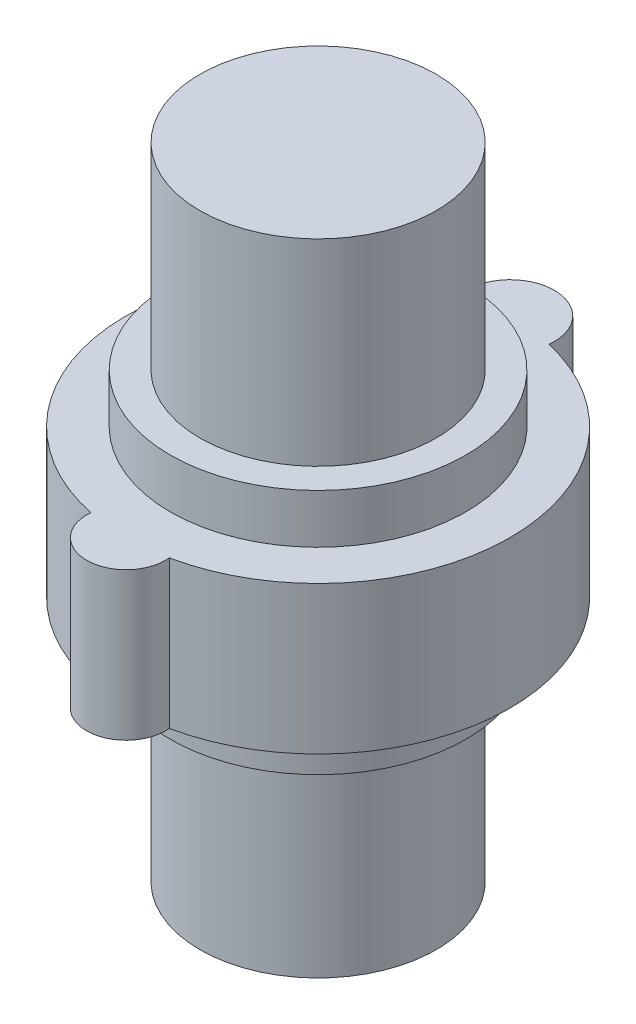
ISO-10303-21;
HEADER;
FILE_DESCRIPTION(('STEP AP214'),'2;1');
FILE_NAME('part.step','',(''),(''),'','','');
FILE_SCHEMA(('AUTOMOTIVE_DESIGN { 1 0 10303 214 1 1 1 1 }'));
ENDSEC;
DATA;
#1=APPLICATION_CONTEXT('core data for automotive mechanical design processes');
#2=APPLICATION_PROTOCOL_DEFINITION('international standard','automotive_design',2000,#1);
#3=PRODUCT_CONTEXT('',#1,'mechanical');
#4=PRODUCT('Part','Part','',(#3));
#5=PRODUCT_RELATED_PRODUCT_CATEGORY('part','',(#4));
#6=PRODUCT_DEFINITION_FORMATION('','',#4);
#7=PRODUCT_DEFINITION_CONTEXT('part definition',#1,'design');
#8=PRODUCT_DEFINITION('design','',#6,#7);
#9=PRODUCT_DEFINITION_SHAPE('','',#8);
#10=(LENGTH_UNIT() NAMED_UNIT(*) SI_UNIT(.MILLI.,.METRE.));
#11=(NAMED_UNIT(*) PLANE_ANGLE_UNIT() SI_UNIT($,.RADIAN.));
#12=(NAMED_UNIT(*) SI_UNIT($,.STERADIAN.) SOLID_ANGLE_UNIT());
#13=UNCERTAINTY_MEASURE_WITH_UNIT(LENGTH_MEASURE(1.E-05),#10,'distance_accuracy_value','');
#14=(GEOMETRIC_REPRESENTATION_CONTEXT(3) GLOBAL_UNCERTAINTY_ASSIGNED_CONTEXT((#13)) GLOBAL_UNIT_ASSIGNED_CONTEXT((#10,
#11,#12)) REPRESENTATION_CONTEXT('',''));
#15=CARTESIAN_POINT('',(0.,0.,0.));
#16=DIRECTION('',(0.,0.,1.));
#17=DIRECTION('',(1.,0.,0.));
#18=AXIS2_PLACEMENT_3D('',#15,#16,#17);
#19=CARTESIAN_POINT('',(0.,3.,-3.9));
#20=DIRECTION('',(0.,-1.,0.));
#21=DIRECTION('',(0.,0.,-1.));
#22=AXIS2_PLACEMENT_3D('',#19,#20,#21);
#23=CYLINDRICAL_SURFACE('',#22,0.9);
#24=CARTESIAN_POINT('',(0.,0.,-3.9));
#25=DIRECTION('',(0.,1.,0.));
#26=DIRECTION('',(0.,0.,-1.));
#27=AXIS2_PLACEMENT_3D('',#24,#25,#26);
#28=CIRCLE('',#27,0.9);
#29=CARTESIAN_POINT('',(0.893988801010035,0.,-3.79615384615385));
#30=VERTEX_POINT('',#29);
#31=CARTESIAN_POINT('',(-0.893988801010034,0.,-3.79615384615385));
#32=VERTEX_POINT('',#31);
#33=EDGE_CURVE('E103',#30,#32,#28,.T.);
#34=ORIENTED_EDGE('',*,*,#33,.T.);
#35=DIRECTION('',(0.,-1.,0.));
#36=VECTOR('',#35,1.);
#37=CARTESIAN_POINT('',(-0.893988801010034,3.,-3.79615384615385));
#38=LINE('',#37,#36);
#39=CARTESIAN_POINT('',(-0.893988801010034,3.,-3.79615384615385));
#40=VERTEX_POINT('',#39);
#41=EDGE_CURVE('E39',#40,#32,#38,.T.);
#42=ORIENTED_EDGE('',*,*,#41,.F.);
#43=CARTESIAN_POINT('',(0.,3.,-3.9));
#44=DIRECTION('',(0.,1.,0.));
#45=DIRECTION('',(0.,0.,-1.));
#46=AXIS2_PLACEMENT_3D('',#43,#44,#45);
#47=CIRCLE('',#46,0.9);
#48=CARTESIAN_POINT('',(0.893988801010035,3.,-3.79615384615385));
#49=VERTEX_POINT('',#48);
#50=EDGE_CURVE('E90',#49,#40,#47,.T.);
#51=ORIENTED_EDGE('',*,*,#50,.F.);
#52=DIRECTION('',(0.,-1.,0.));
#53=VECTOR('',#52,1.);
#54=CARTESIAN_POINT('',(0.893988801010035,3.,-3.79615384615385));
#55=LINE('',#54,#53);
#56=EDGE_CURVE('E99',#49,#30,#55,.T.);
#57=ORIENTED_EDGE('',*,*,#56,.T.);
#58=EDGE_LOOP('',(#34,#42,#51,#57));
#59=FACE_BOUND('',#58,.T.);
#60=ADVANCED_FACE('F36',(#59),#23,.T.);
#61=CARTESIAN_POINT('',(0.,3.,0.));
#62=DIRECTION('',(0.,-1.,0.));
#63=DIRECTION('',(0.,0.,-1.));
#64=AXIS2_PLACEMENT_3D('',#61,#62,#63);
#65=CYLINDRICAL_SURFACE('',#64,3.9);
#66=CARTESIAN_POINT('',(0.,0.,0.));
#67=DIRECTION('',(0.,1.,0.));
#68=DIRECTION('',(0.,0.,1.));
#69=AXIS2_PLACEMENT_3D('',#66,#67,#68);
#70=CIRCLE('',#69,3.9);
#71=CARTESIAN_POINT('',(-0.795781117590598,0.,3.81794871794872));
#72=VERTEX_POINT('',#71);
#73=EDGE_CURVE('E95',#32,#72,#70,.T.);
#74=ORIENTED_EDGE('',*,*,#73,.T.);
#75=DIRECTION('',(0.,-1.,0.));
#76=VECTOR('',#75,1.);
#77=CARTESIAN_POINT('',(-0.795781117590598,3.,3.81794871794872));
#78=LINE('',#77,#76);
#79=CARTESIAN_POINT('',(-0.795781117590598,3.,3.81794871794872));
#80=VERTEX_POINT('',#79);
#81=EDGE_CURVE('E93',#80,#72,#78,.T.);
#82=ORIENTED_EDGE('',*,*,#81,.F.);
#83=CARTESIAN_POINT('',(0.,3.,0.));
#84=DIRECTION('',(0.,1.,0.));
#85=DIRECTION('',(0.,0.,1.));
#86=AXIS2_PLACEMENT_3D('',#83,#84,#85);
#87=CIRCLE('',#86,3.9);
#88=EDGE_CURVE('E85',#40,#80,#87,.T.);
#89=ORIENTED_EDGE('',*,*,#88,.F.);
#90=ORIENTED_EDGE('',*,*,#41,.T.);
#91=EDGE_LOOP('',(#74,#82,#89,#90));
#92=FACE_BOUND('',#91,.T.);
#93=ADVANCED_FACE('F94',(#92),#65,.T.);
#94=CARTESIAN_POINT('',(0.,3.,3.9));
#95=DIRECTION('',(0.,-1.,0.));
#96=DIRECTION('',(0.,0.,-1.));
#97=AXIS2_PLACEMENT_3D('',#94,#95,#96);
#98=CYLINDRICAL_SURFACE('',#97,0.8);
#99=CARTESIAN_POINT('',(0.,0.,3.9));
#100=DIRECTION('',(0.,1.,0.));
#101=DIRECTION('',(0.,0.,1.));
#102=AXIS2_PLACEMENT_3D('',#99,#100,#101);
#103=CIRCLE('',#102,0.8);
#104=CARTESIAN_POINT('',(0.795781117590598,0.,3.81794871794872));
#105=VERTEX_POINT('',#104);
#106=EDGE_CURVE('E71',#72,#105,#103,.T.);
#107=ORIENTED_EDGE('',*,*,#106,.T.);
#108=DIRECTION('',(0.,-1.,0.));
#109=VECTOR('',#108,1.);
#110=CARTESIAN_POINT('',(0.795781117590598,3.,3.81794871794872));
#111=LINE('',#110,#109);
#112=CARTESIAN_POINT('',(0.795781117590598,3.,3.81794871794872));
#113=VERTEX_POINT('',#112);
#114=EDGE_CURVE('E96',#113,#105,#111,.T.);
#115=ORIENTED_EDGE('',*,*,#114,.F.);
#116=CARTESIAN_POINT('',(0.,3.,3.9));
#117=DIRECTION('',(0.,1.,0.));
#118=DIRECTION('',(0.,0.,1.));
#119=AXIS2_PLACEMENT_3D('',#116,#117,#118);
#120=CIRCLE('',#119,0.8);
#121=EDGE_CURVE('E88',#80,#113,#120,.T.);
#122=ORIENTED_EDGE('',*,*,#121,.F.);
#123=ORIENTED_EDGE('',*,*,#81,.T.);
#124=EDGE_LOOP('',(#107,#115,#122,#123));
#125=FACE_BOUND('',#124,.T.);
#126=ADVANCED_FACE('F97',(#125),#98,.T.);
#127=CARTESIAN_POINT('',(0.,3.,0.));
#128=DIRECTION('',(0.,-1.,0.));
#129=DIRECTION('',(0.,0.,-1.));
#130=AXIS2_PLACEMENT_3D('',#127,#128,#129);
#131=CYLINDRICAL_SURFACE('',#130,3.9);
#132=CARTESIAN_POINT('',(0.,0.,0.));
#133=DIRECTION('',(0.,1.,0.));
#134=DIRECTION('',(0.,0.,1.));
#135=AXIS2_PLACEMENT_3D('',#132,#133,#134);
#136=CIRCLE('',#135,3.9);
#137=EDGE_CURVE('E77',#105,#30,#136,.T.);
#138=ORIENTED_EDGE('',*,*,#137,.T.);
#139=ORIENTED_EDGE('',*,*,#56,.F.);
#140=CARTESIAN_POINT('',(0.,3.,0.));
#141=DIRECTION('',(0.,1.,0.));
#142=DIRECTION('',(0.,0.,1.));
#143=AXIS2_PLACEMENT_3D('',#140,#141,#142);
#144=CIRCLE('',#143,3.9);
#145=EDGE_CURVE('E54',#113,#49,#144,.T.);
#146=ORIENTED_EDGE('',*,*,#145,.F.);
#147=ORIENTED_EDGE('',*,*,#114,.T.);
#148=EDGE_LOOP('',(#138,#139,#146,#147));
#149=FACE_BOUND('',#148,.T.);
#150=ADVANCED_FACE('F111',(#149),#131,.T.);
#151=CARTESIAN_POINT('',(0.,3.,-1.95));
#152=DIRECTION('',(0.,-1.,0.));
#153=DIRECTION('',(0.,0.,-1.));
#154=AXIS2_PLACEMENT_3D('',#151,#152,#153);
#155=PLANE('',#154);
#156=CARTESIAN_POINT('',(0.,3.,0.));
#157=DIRECTION('',(0.,1.,0.));
#158=DIRECTION('',(0.,0.,1.));
#159=AXIS2_PLACEMENT_3D('',#156,#157,#158);
#160=CIRCLE('',#159,3.);
#161=CARTESIAN_POINT('',(0.,3.,3.));
#162=VERTEX_POINT('',#161);
#163=EDGE_CURVE('E117',#162,#162,#160,.T.);
#164=ORIENTED_EDGE('',*,*,#163,.F.);
#165=EDGE_LOOP('',(#164));
#166=FACE_BOUND('',#165,.T.);
#167=ORIENTED_EDGE('',*,*,#50,.T.);
#168=ORIENTED_EDGE('',*,*,#88,.T.);
#169=ORIENTED_EDGE('',*,*,#121,.T.);
#170=ORIENTED_EDGE('',*,*,#145,.T.);
#171=EDGE_LOOP('',(#167,#168,#169,#170));
#172=FACE_BOUND('',#171,.T.);
#173=ADVANCED_FACE('F86',(#166,#172),#155,.F.);
#174=CARTESIAN_POINT('',(0.,0.,-1.95));
#175=DIRECTION('',(0.,-1.,0.));
#176=DIRECTION('',(0.,0.,-1.));
#177=AXIS2_PLACEMENT_3D('',#174,#175,#176);
#178=PLANE('',#177);
#179=CARTESIAN_POINT('',(0.,0.,0.));
#180=DIRECTION('',(0.,-1.,0.));
#181=DIRECTION('',(0.,0.,-1.));
#182=AXIS2_PLACEMENT_3D('',#179,#180,#181);
#183=CIRCLE('',#182,3.);
#184=CARTESIAN_POINT('',(0.,0.,-3.));
#185=VERTEX_POINT('',#184);
#186=EDGE_CURVE('E45',#185,#185,#183,.T.);
#187=ORIENTED_EDGE('',*,*,#186,.F.);
#188=EDGE_LOOP('',(#187));
#189=FACE_BOUND('',#188,.T.);
#190=ORIENTED_EDGE('',*,*,#33,.F.);
#191=ORIENTED_EDGE('',*,*,#137,.F.);
#192=ORIENTED_EDGE('',*,*,#106,.F.);
#193=ORIENTED_EDGE('',*,*,#73,.F.);
#194=EDGE_LOOP('',(#190,#191,#192,#193));
#195=FACE_BOUND('',#194,.T.);
#196=ADVANCED_FACE('F114',(#189,#195),#178,.T.);
#197=CARTESIAN_POINT('',(0.,4.,0.));
#198=DIRECTION('',(0.,-1.,0.));
#199=DIRECTION('',(0.,0.,-1.));
#200=AXIS2_PLACEMENT_3D('',#197,#198,#199);
#201=CYLINDRICAL_SURFACE('',#200,3.);
#202=CARTESIAN_POINT('',(0.,4.,0.));
#203=DIRECTION('',(0.,1.,0.));
#204=DIRECTION('',(0.,0.,1.));
#205=AXIS2_PLACEMENT_3D('',#202,#203,#204);
#206=CIRCLE('',#205,3.);
#207=CARTESIAN_POINT('',(0.,4.,3.));
#208=VERTEX_POINT('',#207);
#209=EDGE_CURVE('E106',#208,#208,#206,.T.);
#210=ORIENTED_EDGE('',*,*,#209,.F.);
#211=EDGE_LOOP('',(#210));
#212=FACE_BOUND('',#211,.T.);
#213=ORIENTED_EDGE('',*,*,#163,.T.);
#214=EDGE_LOOP('',(#213));
#215=FACE_BOUND('',#214,.T.);
#216=ADVANCED_FACE('F159',(#212,#215),#201,.T.);
#217=CARTESIAN_POINT('',(0.,4.,0.));
#218=DIRECTION('',(0.,1.,0.));
#219=DIRECTION('',(0.,0.,1.));
#220=AXIS2_PLACEMENT_3D('',#217,#218,#219);
#221=PLANE('',#220);
#222=CARTESIAN_POINT('',(0.,4.,0.));
#223=DIRECTION('',(0.,1.,0.));
#224=DIRECTION('',(0.,0.,1.));
#225=AXIS2_PLACEMENT_3D('',#222,#223,#224);
#226=CIRCLE('',#225,2.4);
#227=CARTESIAN_POINT('',(0.,4.,2.4));
#228=VERTEX_POINT('',#227);
#229=EDGE_CURVE('E120',#228,#228,#226,.T.);
#230=ORIENTED_EDGE('',*,*,#229,.F.);
#231=EDGE_LOOP('',(#230));
#232=FACE_BOUND('',#231,.T.);
#233=ORIENTED_EDGE('',*,*,#209,.T.);
#234=EDGE_LOOP('',(#233));
#235=FACE_BOUND('',#234,.T.);
#236=ADVANCED_FACE('F165',(#232,#235),#221,.T.);
#237=CARTESIAN_POINT('',(0.,8.,0.));
#238=DIRECTION('',(0.,-1.,0.));
#239=DIRECTION('',(0.,0.,-1.));
#240=AXIS2_PLACEMENT_3D('',#237,#238,#239);
#241=CYLINDRICAL_SURFACE('',#240,2.4);
#242=CARTESIAN_POINT('',(0.,8.,0.));
#243=DIRECTION('',(0.,1.,0.));
#244=DIRECTION('',(0.,0.,1.));
#245=AXIS2_PLACEMENT_3D('',#242,#243,#244);
#246=CIRCLE('',#245,2.4);
#247=CARTESIAN_POINT('',(0.,8.,2.4));
#248=VERTEX_POINT('',#247);
#249=EDGE_CURVE('E123',#248,#248,#246,.T.);
#250=ORIENTED_EDGE('',*,*,#249,.F.);
#251=EDGE_LOOP('',(#250));
#252=FACE_BOUND('',#251,.T.);
#253=ORIENTED_EDGE('',*,*,#229,.T.);
#254=EDGE_LOOP('',(#253));
#255=FACE_BOUND('',#254,.T.);
#256=ADVANCED_FACE('F204',(#252,#255),#241,.T.);
#257=CARTESIAN_POINT('',(0.,8.,0.));
#258=DIRECTION('',(0.,1.,0.));
#259=DIRECTION('',(0.,0.,1.));
#260=AXIS2_PLACEMENT_3D('',#257,#258,#259);
#261=PLANE('',#260);
#262=ORIENTED_EDGE('',*,*,#249,.T.);
#263=EDGE_LOOP('',(#262));
#264=FACE_BOUND('',#263,.T.);
#265=ADVANCED_FACE('F154',(#264),#261,.T.);
#266=CARTESIAN_POINT('',(0.,-1.,0.));
#267=DIRECTION('',(0.,1.,0.));
#268=DIRECTION('',(0.,0.,1.));
#269=AXIS2_PLACEMENT_3D('',#266,#267,#268);
#270=CYLINDRICAL_SURFACE('',#269,3.);
#271=CARTESIAN_POINT('',(0.,-1.,0.));
#272=DIRECTION('',(0.,-1.,0.));
#273=DIRECTION('',(0.,0.,-1.));
#274=AXIS2_PLACEMENT_3D('',#271,#272,#273);
#275=CIRCLE('',#274,3.);
#276=CARTESIAN_POINT('',(0.,-1.,-3.));
#277=VERTEX_POINT('',#276);
#278=EDGE_CURVE('E128',#277,#277,#275,.T.);
#279=ORIENTED_EDGE('',*,*,#278,.F.);
#280=EDGE_LOOP('',(#279));
#281=FACE_BOUND('',#280,.T.);
#282=ORIENTED_EDGE('',*,*,#186,.T.);
#283=EDGE_LOOP('',(#282));
#284=FACE_BOUND('',#283,.T.);
#285=ADVANCED_FACE('F148',(#281,#284),#270,.T.);
#286=CARTESIAN_POINT('',(0.,-1.,0.));
#287=DIRECTION('',(0.,-1.,0.));
#288=DIRECTION('',(0.,0.,-1.));
#289=AXIS2_PLACEMENT_3D('',#286,#287,#288);
#290=PLANE('',#289);
#291=CARTESIAN_POINT('',(0.,-1.,0.));
#292=DIRECTION('',(0.,-1.,0.));
#293=DIRECTION('',(0.,0.,-1.));
#294=AXIS2_PLACEMENT_3D('',#291,#292,#293);
#295=CIRCLE('',#294,2.4);
#296=CARTESIAN_POINT('',(0.,-1.,-2.4));
#297=VERTEX_POINT('',#296);
#298=EDGE_CURVE('E11',#297,#297,#295,.T.);
#299=ORIENTED_EDGE('',*,*,#298,.F.);
#300=EDGE_LOOP('',(#299));
#301=FACE_BOUND('',#300,.T.);
#302=ORIENTED_EDGE('',*,*,#278,.T.);
#303=EDGE_LOOP('',(#302));
#304=FACE_BOUND('',#303,.T.);
#305=ADVANCED_FACE('F142',(#301,#304),#290,.T.);
#306=CARTESIAN_POINT('',(0.,-5.,0.));
#307=DIRECTION('',(0.,1.,0.));
#308=DIRECTION('',(0.,0.,1.));
#309=AXIS2_PLACEMENT_3D('',#306,#307,#308);
#310=CYLINDRICAL_SURFACE('',#309,2.4);
#311=CARTESIAN_POINT('',(0.,-5.,0.));
#312=DIRECTION('',(0.,-1.,0.));
#313=DIRECTION('',(0.,0.,-1.));
#314=AXIS2_PLACEMENT_3D('',#311,#312,#313);
#315=CIRCLE('',#314,2.4);
#316=CARTESIAN_POINT('',(0.,-5.,-2.4));
#317=VERTEX_POINT('',#316);
#318=EDGE_CURVE('E132',#317,#317,#315,.T.);
#319=ORIENTED_EDGE('',*,*,#318,.F.);
#320=EDGE_LOOP('',(#319));
#321=FACE_BOUND('',#320,.T.);
#322=ORIENTED_EDGE('',*,*,#298,.T.);
#323=EDGE_LOOP('',(#322));
#324=FACE_BOUND('',#323,.T.);
#325=ADVANCED_FACE('F139',(#321,#324),#310,.T.);
#326=CARTESIAN_POINT('',(0.,-5.,0.));
#327=DIRECTION('',(0.,-1.,0.));
#328=DIRECTION('',(0.,0.,-1.));
#329=AXIS2_PLACEMENT_3D('',#326,#327,#328);
#330=PLANE('',#329);
#331=ORIENTED_EDGE('',*,*,#318,.T.);
#332=EDGE_LOOP('',(#331));
#333=FACE_BOUND('',#332,.T.);
#334=ADVANCED_FACE('F137',(#333),#330,.T.);
#335=CLOSED_SHELL('',(#60,#93,#126,#150,#173,#196,#216,#236,#256,#265,#285,#305,#325,#334));
#336=MANIFOLD_SOLID_BREP('B2',#335);
#337=ADVANCED_BREP_SHAPE_REPRESENTATION('',(#18,#336),#14);
#338=SHAPE_DEFINITION_REPRESENTATION(#9,#337);
ENDSEC;
END-ISO-10303-21;
